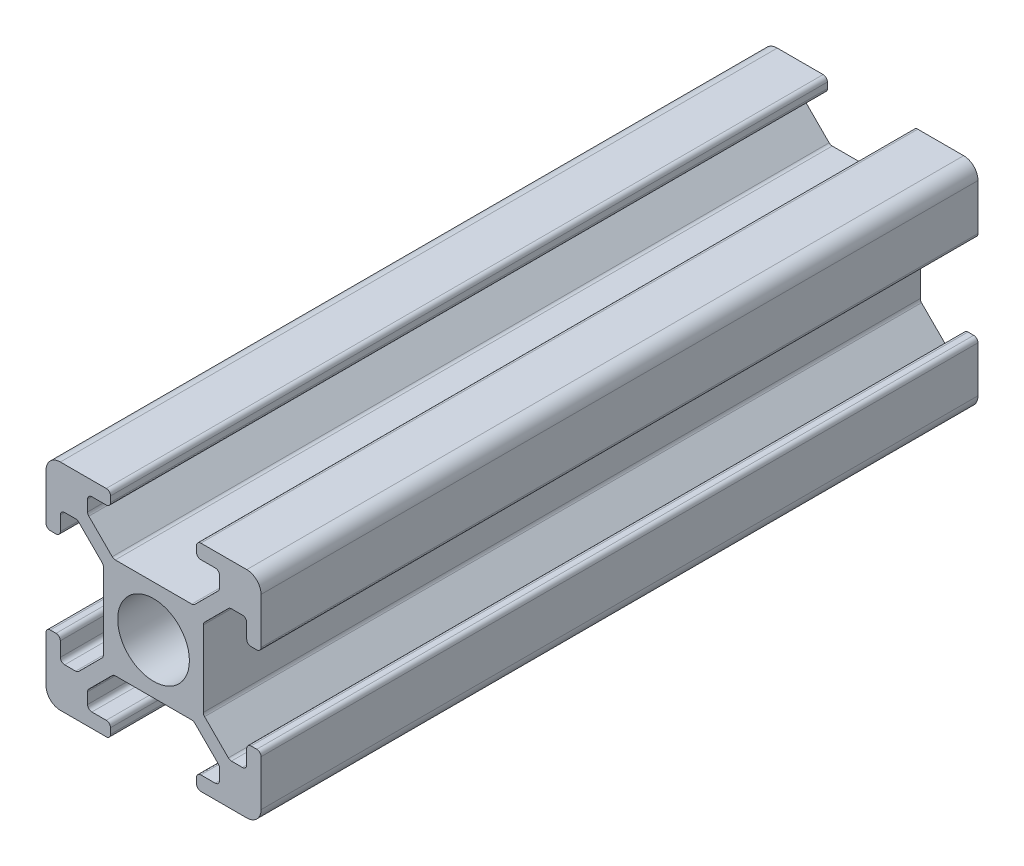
from build123d import *

# Parameters (mm, degrees)
SKETCH1_R           = 2.5
BOSS_EXTRUDE1_DEPTH = 50


with BuildPart() as part:
    # Sketch1 → Boss-Extrude1 (new body)
    with BuildSketch(Plane.XY):
        with BuildLine():
            Line((1, 0), (4.2, 0))
            ThreePointArc((4.2, 0), (4.412132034, 0.087867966), (4.5, 0.3))
            Line((4.5, 0.3), (4.5, 0.7))
            ThreePointArc((4.5, 0.7), (4.412132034, 0.912132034), (4.2, 1))
            Line((4.2, 1), (3.2, 1))
            ThreePointArc((3.2, 1), (2.987867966, 1.087867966), (2.9, 1.3))
            Line((2.9, 1.3), (2.9, 2.06862915))
            ThreePointArc((2.9, 2.06862915), (2.92283614, 2.18343418), (2.987867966, 2.280761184))
            Line((2.987867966, 2.280761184), (4.619238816, 3.912132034))
            ThreePointArc((4.619238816, 3.912132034), (4.71656582, 3.97716386), (4.83137085, 4))
            Line((4.83137085, 4), (10.16862915, 4))
            ThreePointArc((10.16862915, 4), (10.28343418, 3.97716386), (10.380761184, 3.912132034))
            Line((10.380761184, 3.912132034), (12.012132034, 2.280761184))
            ThreePointArc((12.012132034, 2.280761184), (12.07716386, 2.18343418), (12.1, 2.06862915))
            Line((12.1, 2.06862915), (12.1, 1.3))
            ThreePointArc((12.1, 1.3), (12.012132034, 1.087867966), (11.8, 1))
            Line((11.8, 1), (10.8, 1))
            ThreePointArc((10.8, 1), (10.587867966, 0.912132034), (10.5, 0.7))
            Line((10.5, 0.7), (10.5, 0.3))
            ThreePointArc((10.5, 0.3), (10.587867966, 0.087867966), (10.8, 0))
            Line((10.8, 0), (14, 0))
            ThreePointArc((14, 0), (14.707106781, 0.292893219), (15, 1))
            Line((15, 1), (15, 4.2))
            ThreePointArc((15, 4.2), (14.912132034, 4.412132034), (14.7, 4.5))
            Line((14.7, 4.5), (14.3, 4.5))
            ThreePointArc((14.3, 4.5), (14.087867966, 4.412132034), (14, 4.2))
            Line((14, 4.2), (14, 3.2))
            ThreePointArc((14, 3.2), (13.912132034, 2.987867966), (13.7, 2.9))
            Line((13.7, 2.9), (12.93137085, 2.9))
            ThreePointArc((12.93137085, 2.9), (12.81656582, 2.92283614), (12.719238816, 2.987867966))
            Line((12.719238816, 2.987867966), (11.060667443, 4.646439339))
            ThreePointArc((11.060667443, 4.646439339), (10.995635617, 4.743766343), (10.972799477, 4.858571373))
            Line((10.972799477, 4.858571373), (10.972799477, 10.141428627))
            ThreePointArc((10.972799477, 10.141428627), (10.995635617, 10.256233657), (11.060667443, 10.353560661))
            Line((11.060667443, 10.353560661), (12.719238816, 12.012132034))
            ThreePointArc((12.719238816, 12.012132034), (12.81656582, 12.07716386), (12.93137085, 12.1))
            Line((12.93137085, 12.1), (13.7, 12.1))
            ThreePointArc((13.7, 12.1), (13.912132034, 12.012132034), (14, 11.8))
            Line((14, 11.8), (14, 10.8))
            ThreePointArc((14, 10.8), (14.087867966, 10.587867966), (14.3, 10.5))
            Line((14.3, 10.5), (14.7, 10.5))
            ThreePointArc((14.7, 10.5), (14.912132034, 10.587867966), (15, 10.8))
            Line((15, 10.8), (15, 14))
            ThreePointArc((15, 14), (14.707106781, 14.707106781), (14, 15))
            Line((14, 15), (10.8, 15))
            ThreePointArc((10.8, 15), (10.587867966, 14.912132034), (10.5, 14.7))
            Line((10.5, 14.7), (10.5, 14.3))
            ThreePointArc((10.5, 14.3), (10.587867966, 14.087867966), (10.8, 14))
            Line((10.8, 14), (11.8, 14))
            ThreePointArc((11.8, 14), (12.012132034, 13.912132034), (12.1, 13.7))
            Line((12.1, 13.7), (12.1, 12.93137085))
            ThreePointArc((12.1, 12.93137085), (12.07716386, 12.81656582), (12.012132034, 12.719238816))
            Line((12.012132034, 12.719238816), (10.380761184, 11.087867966))
            ThreePointArc((10.380761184, 11.087867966), (10.28343418, 11.02283614), (10.16862915, 11))
            Line((10.16862915, 11), (4.83137085, 11))
            ThreePointArc((4.83137085, 11), (4.71656582, 11.02283614), (4.619238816, 11.087867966))
            Line((4.619238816, 11.087867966), (2.987867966, 12.719238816))
            ThreePointArc((2.987867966, 12.719238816), (2.92283614, 12.81656582), (2.9, 12.93137085))
            Line((2.9, 12.93137085), (2.9, 13.7))
            ThreePointArc((2.9, 13.7), (2.987867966, 13.912132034), (3.2, 14))
            Line((3.2, 14), (4.2, 14))
            ThreePointArc((4.2, 14), (4.412132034, 14.087867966), (4.5, 14.3))
            Line((4.5, 14.3), (4.5, 14.7))
            ThreePointArc((4.5, 14.7), (4.412132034, 14.912132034), (4.2, 15))
            Line((4.2, 15), (1, 15))
            ThreePointArc((1, 15), (0.292893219, 14.707106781), (0, 14))
            Line((0, 14), (0, 10.8))
            ThreePointArc((0, 10.8), (0.087867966, 10.587867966), (0.3, 10.5))
            Line((0.3, 10.5), (0.7, 10.5))
            ThreePointArc((0.7, 10.5), (0.912132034, 10.587867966), (1, 10.8))
            Line((1, 10.8), (1, 11.8))
            ThreePointArc((1, 11.8), (1.087867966, 12.012132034), (1.3, 12.1))
            Line((1.3, 12.1), (2.06862915, 12.1))
            ThreePointArc((2.06862915, 12.1), (2.18343418, 12.07716386), (2.280761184, 12.012132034))
            Line((2.280761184, 12.012132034), (3.912132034, 10.380761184))
            ThreePointArc((3.912132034, 10.380761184), (3.97716386, 10.28343418), (4, 10.16862915))
            Line((4, 10.16862915), (4, 4.83137085))
            ThreePointArc((4, 4.83137085), (3.97716386, 4.71656582), (3.912132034, 4.619238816))
            Line((3.912132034, 4.619238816), (2.280761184, 2.987867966))
            ThreePointArc((2.280761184, 2.987867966), (2.18343418, 2.92283614), (2.06862915, 2.9))
            Line((2.06862915, 2.9), (1.3, 2.9))
            ThreePointArc((1.3, 2.9), (1.087867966, 2.987867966), (1, 3.2))
            Line((1, 3.2), (1, 4.2))
            ThreePointArc((1, 4.2), (0.912132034, 4.412132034), (0.7, 4.5))
            Line((0.7, 4.5), (0.3, 4.5))
            ThreePointArc((0.3, 4.5), (0.087867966, 4.412132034), (0, 4.2))
            Line((0, 4.2), (0, 1))
            ThreePointArc((0, 1), (0.292893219, 0.292893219), (1, 0))
        make_face()
        with Locations((7.5, 7.5)):
            Circle(SKETCH1_R, mode=Mode.SUBTRACT)
    extrude(amount=BOSS_EXTRUDE1_DEPTH)


solid = part.part
